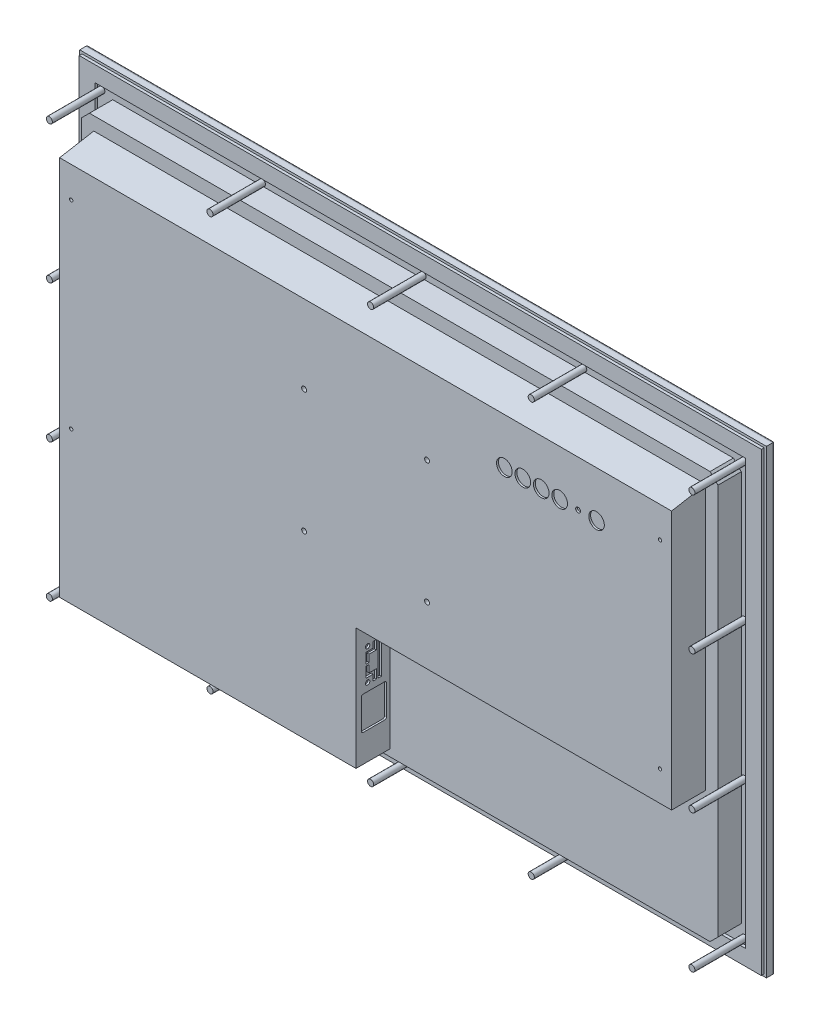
from build123d import *

# Parameters (mm, degrees)
SKETCH1_W                                 = 558.8
SKETCH1_H                                 = 374.65
BEZEL_DEPTH                               = 7.112
BEZEL_RADIUS_R                            = 2
SKETCH2_W                                 = 474.472
SKETCH2_H                                 = 296.672
WINDOW_DEPTH                              = 2.35
SKETCH3_W                                 = 554.99
SKETCH3_H                                 = 370.84
SKETCH3_W_2                               = 529.59
SKETCH3_H_2                               = 345.44
GASKET_DEPTH                              = 2.3
SKETCH5_R                                 = 2.5
PANEL_FRAME_STUDS_DEPTH                   = 42.7
BODY_DEPTH                                = 18.9738
REAR_COVER_DEPTH                          = 27.7876
REAR_COVER_SLOPE_ANGLE                    = 10
SKETCH10_R                                = 1.5875
VIDEO_TOUCH_INTERFACE_DEPTH               = 1.524
SKETCH11_R                                = 1.7907
SKETCH11_W                                = 2.54
SKETCH11_H                                = 27.94
POWER_AC_AND_DC_DEPTH                     = 1.524
SKETCH12_R                                = 6.35
SKETCH12_R_2                              = 1.9812
CONTROLS_BUTTONS_DEPTH                    = 1.524
F_6_32_ACCESSORY_BRACKET_HOLES_AT_2_COUNT = 2
F_6_32_ACCESSORY_BRACKET_HOLES_AT_2_PITCH = 161.3408
F_6_32_ACCESSORY_BRACKET_HOLES_AT_3_COUNT = 2
F_6_32_ACCESSORY_BRACKET_HOLES_AT_3_PITCH = 505.483934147
F_6_32_ACCESSORY_BRACKET_HOLES_AT_4_COUNT = 2
F_6_32_ACCESSORY_BRACKET_HOLES_AT_4_PITCH = 479.044
F_4_0MM_DOWEL_HOLE1_AT_2_COUNT            = 2
F_4_0MM_DOWEL_HOLE1_AT_2_PITCH            = 100
F_4_0MM_DOWEL_HOLE1_AT_3_COUNT            = 2
F_4_0MM_DOWEL_HOLE1_AT_3_PITCH            = 141.421356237
F_4_0MM_DOWEL_HOLE1_AT_4_COUNT            = 2
F_4_0MM_DOWEL_HOLE1_AT_4_PITCH            = 100


with BuildPart() as part:
    # Sketch1 → Bezel (new body)
    with BuildSketch(Plane.XY):
        Rectangle(SKETCH1_W, SKETCH1_H)
    extrude(amount=-BEZEL_DEPTH)

    # Bezel Radius
    bezel_radius_edges = [part.edges().sort_by_distance(p)[0] for p in [
        (279.4, 0, -7.112),
        (0, 187.325, -7.112),
        (-279.4, 0, -7.112),
        (0, -187.325, -7.112),
    ]]
    fillet(bezel_radius_edges, radius=BEZEL_RADIUS_R)

    # Sketch2 → Window (cut)
    with BuildSketch(Plane(origin=(0, 0, -7.112), x_dir=(-1, 0, 0), z_dir=(0, 0, -1))):
        Rectangle(SKETCH2_W, SKETCH2_H)
    extrude(amount=-WINDOW_DEPTH, mode=Mode.SUBTRACT)

    # Sketch3 → Gasket (add)
    with BuildSketch(Plane.XY):
        Rectangle(SKETCH3_W, SKETCH3_H)
        Rectangle(SKETCH3_W_2, SKETCH3_H_2, mode=Mode.SUBTRACT)
    extrude(amount=GASKET_DEPTH)

    # Sketch5 → Panel Frame Studs (add)
    with BuildSketch(Plane.XY):
        with Locations(Location((-261.4168, 168.1226, 0), (0, 0, 180))):
            Circle(SKETCH5_R)
        with Locations(Location((-130.7084, 168.1226, 0), (0, 0, 180))):
            Circle(SKETCH5_R)
        with Locations(Location((-130.7084, -168.148, 0), (0, 0, 180))):
            Circle(SKETCH5_R)
        with Locations(Location((0, 168.1226, 0), (0, 0, 180))):
            Circle(SKETCH5_R)
        with Locations(Location((0, -168.148, 0), (0, 0, 180))):
            Circle(SKETCH5_R)
        with Locations(Location((130.7084, 168.1226, 0), (0, 0, 180))):
            Circle(SKETCH5_R)
        with Locations(Location((130.7084, -168.148, 0), (0, 0, 180))):
            Circle(SKETCH5_R)
        with Locations(Location((261.4168, 168.1226, 0), (0, 0, 180))):
            Circle(SKETCH5_R)
        with Locations(Location((261.4168, -168.148, 0), (0, 0, 180))):
            Circle(SKETCH5_R)
        with Locations(Location((-261.4168, -168.148, 0), (0, 0, 180))):
            Circle(SKETCH5_R)
        with Locations(Location((-261.4168, 56.0324, 0), (0, 0, 180))):
            Circle(SKETCH5_R)
        with Locations(Location((261.4168, 56.0324, 0), (0, 0, 180))):
            Circle(SKETCH5_R)
        with Locations(Location((-261.4168, -56.0578, 0), (0, 0, 180))):
            Circle(SKETCH5_R)
        with Locations(Location((261.4168, -56.0578, 0), (0, 0, 180))):
            Circle(SKETCH5_R)
    extrude(amount=PANEL_FRAME_STUDS_DEPTH)


with BuildPart() as body_2:
    # Sketch6 → Body (new body)
    with BuildSketch(Plane.XY):
        Polygon((-258.9168, 159.21069713), (-252.50489713, 165.6226), (252.50489713, 165.6226), (258.9168, 159.21069713), (258.9168, -159.23609713), (252.50489713, -165.648), (-252.50489713, -165.648), (-258.9168, -159.23609713), align=None)
    extrude(amount=BODY_DEPTH)


with BuildPart() as body_3:
    # Sketch7 → Rear Cover (new body)
    with BuildSketch(Plane.XY.offset(18.9738)):
        Polygon((-248.9708, 154.813), (248.9708, 154.813), (248.9708, -60.833), (-7.8232, -60.833), (-7.8232, -159.893), (-248.9708, -159.893), align=None)
    extrude(amount=REAR_COVER_DEPTH)

    # Rear Cover Slope
    rear_cover_slope_faces = [body_3.faces().sort_by_distance(p)[0] for p in [
        (0, 154.813, 32.8676),
    ]]
    draft(rear_cover_slope_faces, Plane.XY.offset(18.9738), REAR_COVER_SLOPE_ANGLE)

    # Sketch10 → Video _ Touch Interface (cut)
    with BuildSketch(Plane(origin=(0, -60.833, 0), x_dir=(1, 0, 0), z_dir=(0, 1, 0))):
        with Locations((123.334105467, -39.78331993)):
            Circle(SKETCH10_R)
        with Locations((90.822105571, -39.78331993)):
            Circle(SKETCH10_R)
        with Locations((157.223105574, -41.05331993)):
            Circle(SKETCH10_R)
        with Locations((132.223111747, -41.05331993)):
            Circle(SKETCH10_R)
        with Locations((176.282934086, -36.81151993)):
            Circle(SKETCH10_R)
        with Locations((201.282927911, -36.81151993)):
            Circle(SKETCH10_R)
        with BuildLine():
            Line((120.74010861, -42.32331993), (120.74010861, -37.24331993))
            ThreePointArc((120.74010861, -37.24331993), (119.85463367, -35.043615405), (117.692108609, -34.070860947))
            Line((117.692108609, -34.070860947), (96.464102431, -34.070860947))
            ThreePointArc((96.464102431, -34.070860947), (94.30157737, -35.043615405), (93.41610243, -37.24331993))
            Line((93.41610243, -37.24331993), (93.41610243, -42.32331993))
            ThreePointArc((93.41610243, -42.32331993), (94.30157737, -44.523024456), (96.464102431, -45.495778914))
            Line((96.464102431, -45.495778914), (117.692108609, -45.495778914))
            ThreePointArc((117.692108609, -45.495778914), (119.85463367, -44.523024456), (120.74010861, -42.32331993))
        make_face()
        with BuildLine():
            Line((154.883069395, -38.50061993), (154.883069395, -43.58061993))
            ThreePointArc((154.883069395, -43.58061993), (153.997594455, -45.780324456), (151.835069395, -46.753078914))
            Line((151.835069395, -46.753078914), (137.611069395, -46.753078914))
            ThreePointArc((137.611069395, -46.753078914), (135.448544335, -45.780324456), (134.563069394, -43.58061993))
            Line((134.563069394, -43.58061993), (134.563069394, -38.50061993))
            ThreePointArc((134.563069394, -38.50061993), (135.448544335, -36.300915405), (137.611069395, -35.328160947))
            Line((137.611069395, -35.328160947), (151.707497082, -35.325619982))
            ThreePointArc((151.707497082, -35.325619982), (153.952931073, -36.255353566), (154.883069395, -38.50061993))
        make_face()
        with BuildLine():
            Line((178.622891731, -34.28421993), (178.622891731, -39.36421993))
            ThreePointArc((178.622891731, -39.36421993), (179.508366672, -41.563924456), (181.670891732, -42.536678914))
            Line((181.670891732, -42.536678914), (195.767319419, -42.539219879))
            ThreePointArc((195.767319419, -42.539219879), (198.01275341, -41.609486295), (198.942891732, -39.36421993))
            Line((198.942891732, -39.36421993), (198.942891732, -34.28421993))
            ThreePointArc((198.942891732, -34.28421993), (198.057416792, -32.084515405), (195.894891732, -31.111760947))
            Line((195.894891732, -31.111760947), (181.670891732, -31.111760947))
            ThreePointArc((181.670891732, -31.111760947), (179.508366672, -32.084515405), (178.622891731, -34.28421993))
        make_face()
        with BuildLine():
            Line((232.390303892, -30.71551993), (216.388303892, -30.71551993))
            Line((216.388303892, -30.71551993), (216.388303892, -35.22401993))
            Line((216.388303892, -35.22401993), (211.943303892, -35.22401993))
            ThreePointArc((211.943303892, -35.22401993), (210.355803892, -36.81151993), (211.943303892, -38.39901993))
            Line((211.943303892, -38.39901993), (216.388303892, -38.39901993))
            Line((216.388303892, -38.39901993), (216.388303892, -42.90751993))
            Line((216.388303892, -42.90751993), (232.390303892, -42.90751993))
            Line((232.390303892, -42.90751993), (232.390303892, -38.39901993))
            Line((232.390303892, -38.39901993), (236.835303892, -38.39901993))
            ThreePointArc((236.835303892, -38.39901993), (238.422803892, -36.81151993), (236.835303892, -35.22401993))
            Line((236.835303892, -35.22401993), (232.390303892, -35.22401993))
            Line((232.390303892, -35.22401993), (232.390303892, -30.71551993))
        make_face()
    extrude(amount=VIDEO_TOUCH_INTERFACE_DEPTH, mode=Mode.SUBTRACT)

    # Sketch11 → Power AC and DC (cut)
    with BuildSketch(Plane.ZY.offset(7.8232)):
        with Locations(Location((37.2872, -104.042596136, 0), (0, 0, 180))):
            Circle(SKETCH11_R)
        with Locations(Location((37.2872, -78.464796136, 0), (0, 0, 180))):
            Circle(SKETCH11_R)
        Polygon((32.7914, -105.223696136), (32.7914, -100.410396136), (38.6842, -100.410396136), (38.6842, -92.015696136), (36.1442, -92.015696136), (36.1442, -97.870396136), (30.2514, -97.870396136), (30.2514, -105.223696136), align=None)
        with Locations((27.4574, -91.253696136)):
            Rectangle(SKETCH11_W, SKETCH11_H)
        Polygon((30.2514, -77.283696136), (32.7914, -77.283696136), (32.7914, -82.096996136), (38.6842, -82.096996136), (38.6842, -90.491696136), (36.1442, -90.491696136), (36.1442, -84.636996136), (30.2514, -84.636996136), align=None)
        with BuildLine():
            Line((21.933143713, -111.95585365), (21.933143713, -135.89535204))
            ThreePointArc((21.933143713, -135.89535204), (22.379512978, -136.972982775), (23.457143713, -137.41935204))
            Line((23.457143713, -137.41935204), (40.906952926, -137.41935204))
            ThreePointArc((40.906952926, -137.41935204), (41.984583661, -136.972982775), (42.430952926, -135.89535204))
            Line((42.430952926, -135.89535204), (42.430952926, -111.95585365))
            ThreePointArc((42.430952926, -111.95585365), (41.984583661, -110.878222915), (40.906952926, -110.43185365))
            Line((40.906952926, -110.43185365), (23.457143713, -110.43185365))
            ThreePointArc((23.457143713, -110.43185365), (22.379512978, -110.878222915), (21.933143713, -111.95585365))
        make_face()
    extrude(amount=POWER_AC_AND_DC_DEPTH, mode=Mode.SUBTRACT)

    # Sketch12 → Controls Buttons (cut)
    with BuildSketch(Plane.XY.offset(46.7614)):
        with Locations((112.912959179, 112.600932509)):
            Circle(SKETCH12_R)
        with Locations((127.912959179, 112.600932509)):
            Circle(SKETCH12_R)
        with Locations((142.912959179, 112.600932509)):
            Circle(SKETCH12_R)
        with Locations((157.912959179, 112.600932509)):
            Circle(SKETCH12_R)
        with Locations((172.912959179, 112.600932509)):
            Circle(SKETCH12_R_2)
        with Locations((187.912959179, 112.600932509)):
            Circle(SKETCH12_R)
    extrude(amount=-CONTROLS_BUTTONS_DEPTH, mode=Mode.SUBTRACT)

    # Sketch14 → 6-32 Accessory Bracket Holes (revolve, cut)
    with BuildSketch(Plane(origin=(-239.522, -36.449, 46.7614), x_dir=(0, -1, 0), z_dir=(1, 0, 0))):
        Polygon((0, 0), (0, 16.81469403), (1.35255, 16.002), (1.35255, 0), align=None)
    f_6_32_accessory_bracket_holes = revolve(axis=Axis((-239.522, -36.449, 53.1114), (0, 0, -1)), mode=Mode.SUBTRACT)

    # 6-32 Accessory Bracket Holes at 2: 6-32 Accessory Bracket Holes ×2
    with Locations(*[(0, i * F_6_32_ACCESSORY_BRACKET_HOLES_AT_2_PITCH, 0) for i in range(1, F_6_32_ACCESSORY_BRACKET_HOLES_AT_2_COUNT)]):
        add(f_6_32_accessory_bracket_holes, mode=Mode.SUBTRACT)

    # 6-32 Accessory Bracket Holes at 3: 6-32 Accessory Bracket Holes ×2
    with Locations(*[Vector(0.9476938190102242, 0.31918086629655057, 0) * (i * F_6_32_ACCESSORY_BRACKET_HOLES_AT_3_PITCH) for i in range(1, F_6_32_ACCESSORY_BRACKET_HOLES_AT_3_COUNT)]):
        add(f_6_32_accessory_bracket_holes, mode=Mode.SUBTRACT)

    # 6-32 Accessory Bracket Holes at 4: 6-32 Accessory Bracket Holes ×2
    with Locations(*[(i * F_6_32_ACCESSORY_BRACKET_HOLES_AT_4_PITCH, 0, 0) for i in range(1, F_6_32_ACCESSORY_BRACKET_HOLES_AT_4_COUNT)]):
        add(f_6_32_accessory_bracket_holes, mode=Mode.SUBTRACT)

    # Sketch16 → 4.0mm Dowel Hole1 (revolve, cut)
    with BuildSketch(Plane(origin=(-50, 86.322, 46.7614), x_dir=(0, -1, 0), z_dir=(1, 0, 0))):
        Polygon((0, 0), (0, 17.203721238), (2, 16.002), (2, 0), align=None)
    f_4_0mm_dowel_hole1 = revolve(axis=Axis((-50, 86.322, 53.1114), (0, 0, -1)), mode=Mode.SUBTRACT)

    # 4.0mm Dowel Hole1 at 2: 4.0mm Dowel Hole1 ×2
    with Locations(*[(i * F_4_0MM_DOWEL_HOLE1_AT_2_PITCH, 0, 0) for i in range(1, F_4_0MM_DOWEL_HOLE1_AT_2_COUNT)]):
        add(f_4_0mm_dowel_hole1, mode=Mode.SUBTRACT)

    # 4.0mm Dowel Hole1 at 3: 4.0mm Dowel Hole1 ×2
    with Locations(*[Vector(0.7071067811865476, -0.7071067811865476, 0) * (i * F_4_0MM_DOWEL_HOLE1_AT_3_PITCH) for i in range(1, F_4_0MM_DOWEL_HOLE1_AT_3_COUNT)]):
        add(f_4_0mm_dowel_hole1, mode=Mode.SUBTRACT)

    # 4.0mm Dowel Hole1 at 4: 4.0mm Dowel Hole1 ×2
    with Locations(*[(0, -i * F_4_0MM_DOWEL_HOLE1_AT_4_PITCH, 0) for i in range(1, F_4_0MM_DOWEL_HOLE1_AT_4_COUNT)]):
        add(f_4_0mm_dowel_hole1, mode=Mode.SUBTRACT)


solid = Compound([part.part, body_2.part, body_3.part])
